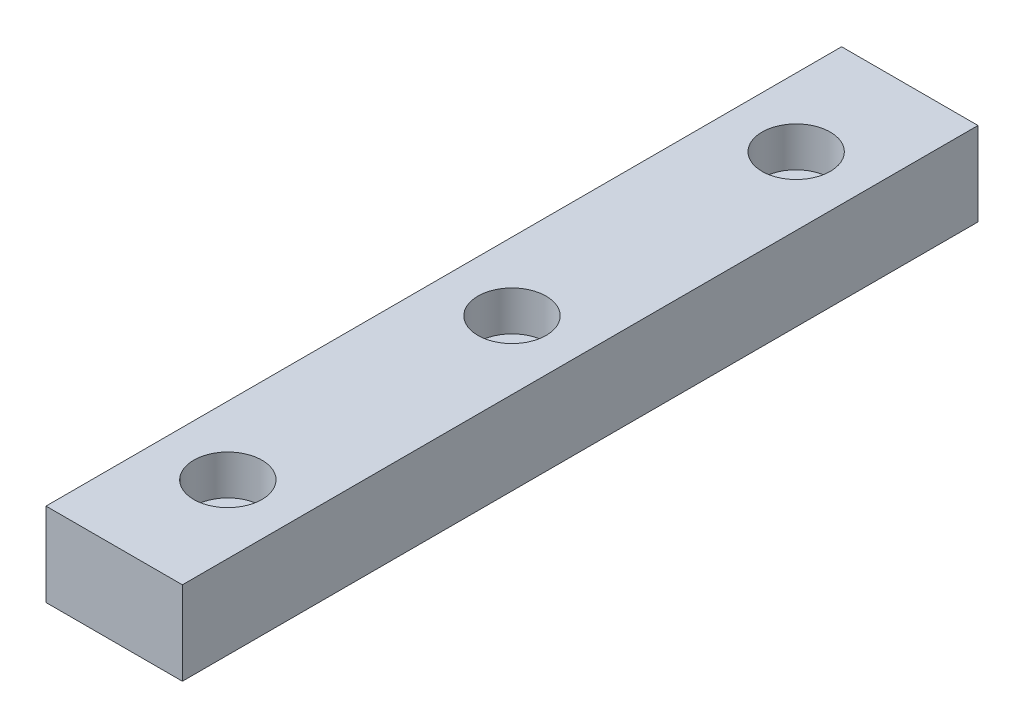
ISO-10303-21;
HEADER;
FILE_DESCRIPTION(('STEP AP214'),'2;1');
FILE_NAME('part.step','',(''),(''),'','','');
FILE_SCHEMA(('AUTOMOTIVE_DESIGN { 1 0 10303 214 1 1 1 1 }'));
ENDSEC;
DATA;
#1=APPLICATION_CONTEXT('core data for automotive mechanical design processes');
#2=APPLICATION_PROTOCOL_DEFINITION('international standard','automotive_design',2000,#1);
#3=PRODUCT_CONTEXT('',#1,'mechanical');
#4=PRODUCT('Part','Part','',(#3));
#5=PRODUCT_RELATED_PRODUCT_CATEGORY('part','',(#4));
#6=PRODUCT_DEFINITION_FORMATION('','',#4);
#7=PRODUCT_DEFINITION_CONTEXT('part definition',#1,'design');
#8=PRODUCT_DEFINITION('design','',#6,#7);
#9=PRODUCT_DEFINITION_SHAPE('','',#8);
#10=(LENGTH_UNIT() NAMED_UNIT(*) SI_UNIT(.MILLI.,.METRE.));
#11=(NAMED_UNIT(*) PLANE_ANGLE_UNIT() SI_UNIT($,.RADIAN.));
#12=(NAMED_UNIT(*) SI_UNIT($,.STERADIAN.) SOLID_ANGLE_UNIT());
#13=UNCERTAINTY_MEASURE_WITH_UNIT(LENGTH_MEASURE(1.E-05),#10,'distance_accuracy_value','');
#14=(GEOMETRIC_REPRESENTATION_CONTEXT(3) GLOBAL_UNCERTAINTY_ASSIGNED_CONTEXT((#13)) GLOBAL_UNIT_ASSIGNED_CONTEXT((#10,
#11,#12)) REPRESENTATION_CONTEXT('',''));
#15=CARTESIAN_POINT('',(0.,0.,0.));
#16=DIRECTION('',(0.,0.,1.));
#17=DIRECTION('',(1.,0.,0.));
#18=AXIS2_PLACEMENT_3D('',#15,#16,#17);
#19=CARTESIAN_POINT('',(6.,-62.6500000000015,10.));
#20=DIRECTION('',(0.,1.,0.));
#21=DIRECTION('',(0.,0.,1.));
#22=AXIS2_PLACEMENT_3D('',#19,#20,#21);
#23=CYLINDRICAL_SURFACE('',#22,1.75);
#24=CARTESIAN_POINT('',(6.,0.,10.));
#25=DIRECTION('',(0.,1.,0.));
#26=DIRECTION('',(0.,0.,1.));
#27=AXIS2_PLACEMENT_3D('',#24,#25,#26);
#28=CIRCLE('',#27,1.75);
#29=CARTESIAN_POINT('',(6.,0.,11.75));
#30=VERTEX_POINT('',#29);
#31=EDGE_CURVE('E110',#30,#30,#28,.T.);
#32=ORIENTED_EDGE('',*,*,#31,.F.);
#33=EDGE_LOOP('',(#32));
#34=FACE_BOUND('',#33,.T.);
#35=CARTESIAN_POINT('',(6.,3.84999999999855,10.));
#36=DIRECTION('',(0.,1.,0.));
#37=DIRECTION('',(0.,0.,1.));
#38=AXIS2_PLACEMENT_3D('',#35,#36,#37);
#39=CIRCLE('',#38,1.75);
#40=CARTESIAN_POINT('',(6.,3.84999999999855,11.75));
#41=VERTEX_POINT('',#40);
#42=EDGE_CURVE('E36',#41,#41,#39,.F.);
#43=ORIENTED_EDGE('',*,*,#42,.F.);
#44=EDGE_LOOP('',(#43));
#45=FACE_BOUND('',#44,.T.);
#46=ADVANCED_FACE('F32',(#34,#45),#23,.F.);
#47=CARTESIAN_POINT('',(6.,-62.6500000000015,35.));
#48=DIRECTION('',(0.,1.,0.));
#49=DIRECTION('',(0.,0.,1.));
#50=AXIS2_PLACEMENT_3D('',#47,#48,#49);
#51=CYLINDRICAL_SURFACE('',#50,1.75);
#52=CARTESIAN_POINT('',(6.,0.,35.));
#53=DIRECTION('',(0.,1.,0.));
#54=DIRECTION('',(0.,0.,1.));
#55=AXIS2_PLACEMENT_3D('',#52,#53,#54);
#56=CIRCLE('',#55,1.75);
#57=CARTESIAN_POINT('',(6.,0.,36.75));
#58=VERTEX_POINT('',#57);
#59=EDGE_CURVE('E135',#58,#58,#56,.T.);
#60=ORIENTED_EDGE('',*,*,#59,.F.);
#61=EDGE_LOOP('',(#60));
#62=FACE_BOUND('',#61,.T.);
#63=CARTESIAN_POINT('',(6.,3.84999999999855,35.));
#64=DIRECTION('',(0.,1.,0.));
#65=DIRECTION('',(0.,0.,1.));
#66=AXIS2_PLACEMENT_3D('',#63,#64,#65);
#67=CIRCLE('',#66,1.75);
#68=CARTESIAN_POINT('',(6.,3.84999999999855,36.75));
#69=VERTEX_POINT('',#68);
#70=EDGE_CURVE('E112',#69,#69,#67,.F.);
#71=ORIENTED_EDGE('',*,*,#70,.F.);
#72=EDGE_LOOP('',(#71));
#73=FACE_BOUND('',#72,.T.);
#74=ADVANCED_FACE('F145',(#62,#73),#51,.F.);
#75=CARTESIAN_POINT('',(6.,-62.6500000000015,60.));
#76=DIRECTION('',(0.,1.,0.));
#77=DIRECTION('',(0.,0.,1.));
#78=AXIS2_PLACEMENT_3D('',#75,#76,#77);
#79=CYLINDRICAL_SURFACE('',#78,1.75);
#80=CARTESIAN_POINT('',(6.,0.,60.));
#81=DIRECTION('',(0.,1.,0.));
#82=DIRECTION('',(0.,0.,1.));
#83=AXIS2_PLACEMENT_3D('',#80,#81,#82);
#84=CIRCLE('',#83,1.75);
#85=CARTESIAN_POINT('',(6.,0.,61.75));
#86=VERTEX_POINT('',#85);
#87=EDGE_CURVE('E102',#86,#86,#84,.T.);
#88=ORIENTED_EDGE('',*,*,#87,.F.);
#89=EDGE_LOOP('',(#88));
#90=FACE_BOUND('',#89,.T.);
#91=CARTESIAN_POINT('',(6.,3.84999999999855,60.));
#92=DIRECTION('',(0.,1.,0.));
#93=DIRECTION('',(0.,0.,1.));
#94=AXIS2_PLACEMENT_3D('',#91,#92,#93);
#95=CIRCLE('',#94,1.75);
#96=CARTESIAN_POINT('',(6.,3.84999999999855,61.75));
#97=VERTEX_POINT('',#96);
#98=EDGE_CURVE('E108',#97,#97,#95,.F.);
#99=ORIENTED_EDGE('',*,*,#98,.F.);
#100=EDGE_LOOP('',(#99));
#101=FACE_BOUND('',#100,.T.);
#102=ADVANCED_FACE('F142',(#90,#101),#79,.F.);
#103=CARTESIAN_POINT('',(0.,0.,70.));
#104=DIRECTION('',(1.,0.,0.));
#105=DIRECTION('',(0.,0.,-1.));
#106=AXIS2_PLACEMENT_3D('',#103,#104,#105);
#107=PLANE('',#106);
#108=DIRECTION('',(0.,-1.,0.));
#109=VECTOR('',#108,1.);
#110=CARTESIAN_POINT('',(0.,0.,0.));
#111=LINE('',#110,#109);
#112=CARTESIAN_POINT('',(0.,7.34999999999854,0.));
#113=VERTEX_POINT('',#112);
#114=CARTESIAN_POINT('',(0.,0.,0.));
#115=VERTEX_POINT('',#114);
#116=EDGE_CURVE('E99',#113,#115,#111,.T.);
#117=ORIENTED_EDGE('',*,*,#116,.T.);
#118=DIRECTION('',(0.,0.,-1.));
#119=VECTOR('',#118,1.);
#120=CARTESIAN_POINT('',(0.,0.,70.));
#121=LINE('',#120,#119);
#122=CARTESIAN_POINT('',(0.,0.,70.));
#123=VERTEX_POINT('',#122);
#124=EDGE_CURVE('E11',#123,#115,#121,.T.);
#125=ORIENTED_EDGE('',*,*,#124,.F.);
#126=DIRECTION('',(0.,-1.,0.));
#127=VECTOR('',#126,1.);
#128=CARTESIAN_POINT('',(0.,0.,70.));
#129=LINE('',#128,#127);
#130=CARTESIAN_POINT('',(0.,7.34999999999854,70.));
#131=VERTEX_POINT('',#130);
#132=EDGE_CURVE('E86',#131,#123,#129,.T.);
#133=ORIENTED_EDGE('',*,*,#132,.F.);
#134=DIRECTION('',(0.,0.,-1.));
#135=VECTOR('',#134,1.);
#136=CARTESIAN_POINT('',(0.,7.34999999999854,70.));
#137=LINE('',#136,#135);
#138=EDGE_CURVE('E95',#131,#113,#137,.T.);
#139=ORIENTED_EDGE('',*,*,#138,.T.);
#140=EDGE_LOOP('',(#117,#125,#133,#139));
#141=FACE_BOUND('',#140,.T.);
#142=ADVANCED_FACE('F34',(#141),#107,.F.);
#143=CARTESIAN_POINT('',(0.,0.,70.));
#144=DIRECTION('',(0.,1.,0.));
#145=DIRECTION('',(0.,0.,1.));
#146=AXIS2_PLACEMENT_3D('',#143,#144,#145);
#147=PLANE('',#146);
#148=ORIENTED_EDGE('',*,*,#31,.T.);
#149=EDGE_LOOP('',(#148));
#150=FACE_BOUND('',#149,.T.);
#151=ORIENTED_EDGE('',*,*,#59,.T.);
#152=EDGE_LOOP('',(#151));
#153=FACE_BOUND('',#152,.T.);
#154=ORIENTED_EDGE('',*,*,#87,.T.);
#155=EDGE_LOOP('',(#154));
#156=FACE_BOUND('',#155,.T.);
#157=DIRECTION('',(1.,0.,0.));
#158=VECTOR('',#157,1.);
#159=CARTESIAN_POINT('',(0.,0.,0.));
#160=LINE('',#159,#158);
#161=CARTESIAN_POINT('',(12.,0.,0.));
#162=VERTEX_POINT('',#161);
#163=EDGE_CURVE('E90',#115,#162,#160,.T.);
#164=ORIENTED_EDGE('',*,*,#163,.T.);
#165=DIRECTION('',(0.,0.,-1.));
#166=VECTOR('',#165,1.);
#167=CARTESIAN_POINT('',(12.,0.,70.));
#168=LINE('',#167,#166);
#169=CARTESIAN_POINT('',(12.,0.,70.));
#170=VERTEX_POINT('',#169);
#171=EDGE_CURVE('E42',#170,#162,#168,.T.);
#172=ORIENTED_EDGE('',*,*,#171,.F.);
#173=DIRECTION('',(1.,0.,0.));
#174=VECTOR('',#173,1.);
#175=CARTESIAN_POINT('',(0.,0.,70.));
#176=LINE('',#175,#174);
#177=EDGE_CURVE('E81',#123,#170,#176,.T.);
#178=ORIENTED_EDGE('',*,*,#177,.F.);
#179=ORIENTED_EDGE('',*,*,#124,.T.);
#180=EDGE_LOOP('',(#164,#172,#178,#179));
#181=FACE_BOUND('',#180,.T.);
#182=ADVANCED_FACE('F89',(#150,#153,#156,#181),#147,.F.);
#183=CARTESIAN_POINT('',(12.,0.,70.));
#184=DIRECTION('',(-1.,0.,0.));
#185=DIRECTION('',(0.,0.,1.));
#186=AXIS2_PLACEMENT_3D('',#183,#184,#185);
#187=PLANE('',#186);
#188=DIRECTION('',(0.,1.,0.));
#189=VECTOR('',#188,1.);
#190=CARTESIAN_POINT('',(12.,0.,0.));
#191=LINE('',#190,#189);
#192=CARTESIAN_POINT('',(12.,7.34999999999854,0.));
#193=VERTEX_POINT('',#192);
#194=EDGE_CURVE('E68',#162,#193,#191,.T.);
#195=ORIENTED_EDGE('',*,*,#194,.T.);
#196=DIRECTION('',(0.,0.,-1.));
#197=VECTOR('',#196,1.);
#198=CARTESIAN_POINT('',(12.,7.34999999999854,70.));
#199=LINE('',#198,#197);
#200=CARTESIAN_POINT('',(12.,7.34999999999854,70.));
#201=VERTEX_POINT('',#200);
#202=EDGE_CURVE('E91',#201,#193,#199,.T.);
#203=ORIENTED_EDGE('',*,*,#202,.F.);
#204=DIRECTION('',(0.,1.,0.));
#205=VECTOR('',#204,1.);
#206=CARTESIAN_POINT('',(12.,0.,70.));
#207=LINE('',#206,#205);
#208=EDGE_CURVE('E84',#170,#201,#207,.T.);
#209=ORIENTED_EDGE('',*,*,#208,.F.);
#210=ORIENTED_EDGE('',*,*,#171,.T.);
#211=EDGE_LOOP('',(#195,#203,#209,#210));
#212=FACE_BOUND('',#211,.T.);
#213=ADVANCED_FACE('F93',(#212),#187,.F.);
#214=CARTESIAN_POINT('',(0.,7.34999999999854,70.));
#215=DIRECTION('',(0.,-1.,0.));
#216=DIRECTION('',(0.,0.,-1.));
#217=AXIS2_PLACEMENT_3D('',#214,#215,#216);
#218=PLANE('',#217);
#219=CARTESIAN_POINT('',(6.,7.34999999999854,10.));
#220=DIRECTION('',(0.,1.,0.));
#221=DIRECTION('',(0.,0.,1.));
#222=AXIS2_PLACEMENT_3D('',#219,#220,#221);
#223=CIRCLE('',#222,3.);
#224=CARTESIAN_POINT('',(6.,7.34999999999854,13.));
#225=VERTEX_POINT('',#224);
#226=EDGE_CURVE('E128',#225,#225,#223,.T.);
#227=ORIENTED_EDGE('',*,*,#226,.F.);
#228=EDGE_LOOP('',(#227));
#229=FACE_BOUND('',#228,.T.);
#230=CARTESIAN_POINT('',(6.,7.34999999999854,35.));
#231=DIRECTION('',(0.,1.,0.));
#232=DIRECTION('',(0.,0.,1.));
#233=AXIS2_PLACEMENT_3D('',#230,#231,#232);
#234=CIRCLE('',#233,3.);
#235=CARTESIAN_POINT('',(6.,7.34999999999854,38.));
#236=VERTEX_POINT('',#235);
#237=EDGE_CURVE('E121',#236,#236,#234,.T.);
#238=ORIENTED_EDGE('',*,*,#237,.F.);
#239=EDGE_LOOP('',(#238));
#240=FACE_BOUND('',#239,.T.);
#241=CARTESIAN_POINT('',(6.,7.34999999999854,60.));
#242=DIRECTION('',(0.,1.,0.));
#243=DIRECTION('',(0.,0.,1.));
#244=AXIS2_PLACEMENT_3D('',#241,#242,#243);
#245=CIRCLE('',#244,3.);
#246=CARTESIAN_POINT('',(6.,7.34999999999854,63.));
#247=VERTEX_POINT('',#246);
#248=EDGE_CURVE('E114',#247,#247,#245,.T.);
#249=ORIENTED_EDGE('',*,*,#248,.F.);
#250=EDGE_LOOP('',(#249));
#251=FACE_BOUND('',#250,.T.);
#252=DIRECTION('',(-1.,0.,0.));
#253=VECTOR('',#252,1.);
#254=CARTESIAN_POINT('',(0.,7.34999999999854,0.));
#255=LINE('',#254,#253);
#256=EDGE_CURVE('E74',#193,#113,#255,.T.);
#257=ORIENTED_EDGE('',*,*,#256,.T.);
#258=ORIENTED_EDGE('',*,*,#138,.F.);
#259=DIRECTION('',(-1.,0.,0.));
#260=VECTOR('',#259,1.);
#261=CARTESIAN_POINT('',(0.,7.34999999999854,70.));
#262=LINE('',#261,#260);
#263=EDGE_CURVE('E51',#201,#131,#262,.T.);
#264=ORIENTED_EDGE('',*,*,#263,.F.);
#265=ORIENTED_EDGE('',*,*,#202,.T.);
#266=EDGE_LOOP('',(#257,#258,#264,#265));
#267=FACE_BOUND('',#266,.T.);
#268=ADVANCED_FACE('F177',(#229,#240,#251,#267),#218,.F.);
#269=CARTESIAN_POINT('',(0.,7.34999999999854,70.));
#270=DIRECTION('',(0.,0.,-1.));
#271=DIRECTION('',(-1.,0.,0.));
#272=AXIS2_PLACEMENT_3D('',#269,#270,#271);
#273=PLANE('',#272);
#274=ORIENTED_EDGE('',*,*,#132,.T.);
#275=ORIENTED_EDGE('',*,*,#177,.T.);
#276=ORIENTED_EDGE('',*,*,#208,.T.);
#277=ORIENTED_EDGE('',*,*,#263,.T.);
#278=EDGE_LOOP('',(#274,#275,#276,#277));
#279=FACE_BOUND('',#278,.T.);
#280=ADVANCED_FACE('F82',(#279),#273,.F.);
#281=CARTESIAN_POINT('',(0.,7.34999999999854,0.));
#282=DIRECTION('',(0.,0.,-1.));
#283=DIRECTION('',(-1.,0.,0.));
#284=AXIS2_PLACEMENT_3D('',#281,#282,#283);
#285=PLANE('',#284);
#286=ORIENTED_EDGE('',*,*,#116,.F.);
#287=ORIENTED_EDGE('',*,*,#256,.F.);
#288=ORIENTED_EDGE('',*,*,#194,.F.);
#289=ORIENTED_EDGE('',*,*,#163,.F.);
#290=EDGE_LOOP('',(#286,#287,#288,#289));
#291=FACE_BOUND('',#290,.T.);
#292=ADVANCED_FACE('F152',(#291),#285,.T.);
#293=CARTESIAN_POINT('',(6.,3.84999999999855,60.));
#294=DIRECTION('',(0.,1.,0.));
#295=DIRECTION('',(0.,0.,1.));
#296=AXIS2_PLACEMENT_3D('',#293,#294,#295);
#297=PLANE('',#296);
#298=CARTESIAN_POINT('',(6.,3.84999999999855,60.));
#299=DIRECTION('',(0.,1.,0.));
#300=DIRECTION('',(0.,0.,1.));
#301=AXIS2_PLACEMENT_3D('',#298,#299,#300);
#302=CIRCLE('',#301,3.);
#303=CARTESIAN_POINT('',(6.,3.84999999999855,63.));
#304=VERTEX_POINT('',#303);
#305=EDGE_CURVE('E111',#304,#304,#302,.T.);
#306=ORIENTED_EDGE('',*,*,#305,.T.);
#307=EDGE_LOOP('',(#306));
#308=FACE_BOUND('',#307,.T.);
#309=ORIENTED_EDGE('',*,*,#98,.T.);
#310=EDGE_LOOP('',(#309));
#311=FACE_BOUND('',#310,.T.);
#312=ADVANCED_FACE('F149',(#308,#311),#297,.T.);
#313=CARTESIAN_POINT('',(6.,3.84999999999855,60.));
#314=DIRECTION('',(0.,1.,0.));
#315=DIRECTION('',(0.,0.,1.));
#316=AXIS2_PLACEMENT_3D('',#313,#314,#315);
#317=CYLINDRICAL_SURFACE('',#316,3.);
#318=ORIENTED_EDGE('',*,*,#305,.F.);
#319=EDGE_LOOP('',(#318));
#320=FACE_BOUND('',#319,.T.);
#321=ORIENTED_EDGE('',*,*,#248,.T.);
#322=EDGE_LOOP('',(#321));
#323=FACE_BOUND('',#322,.T.);
#324=ADVANCED_FACE('F151',(#320,#323),#317,.F.);
#325=CARTESIAN_POINT('',(6.,3.84999999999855,35.));
#326=DIRECTION('',(0.,1.,0.));
#327=DIRECTION('',(0.,0.,1.));
#328=AXIS2_PLACEMENT_3D('',#325,#326,#327);
#329=PLANE('',#328);
#330=CARTESIAN_POINT('',(6.,3.84999999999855,35.));
#331=DIRECTION('',(0.,1.,0.));
#332=DIRECTION('',(0.,0.,1.));
#333=AXIS2_PLACEMENT_3D('',#330,#331,#332);
#334=CIRCLE('',#333,3.);
#335=CARTESIAN_POINT('',(6.,3.84999999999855,38.));
#336=VERTEX_POINT('',#335);
#337=EDGE_CURVE('E115',#336,#336,#334,.T.);
#338=ORIENTED_EDGE('',*,*,#337,.T.);
#339=EDGE_LOOP('',(#338));
#340=FACE_BOUND('',#339,.T.);
#341=ORIENTED_EDGE('',*,*,#70,.T.);
#342=EDGE_LOOP('',(#341));
#343=FACE_BOUND('',#342,.T.);
#344=ADVANCED_FACE('F159',(#340,#343),#329,.T.);
#345=CARTESIAN_POINT('',(6.,3.84999999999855,35.));
#346=DIRECTION('',(0.,1.,0.));
#347=DIRECTION('',(0.,0.,1.));
#348=AXIS2_PLACEMENT_3D('',#345,#346,#347);
#349=CYLINDRICAL_SURFACE('',#348,3.);
#350=ORIENTED_EDGE('',*,*,#337,.F.);
#351=EDGE_LOOP('',(#350));
#352=FACE_BOUND('',#351,.T.);
#353=ORIENTED_EDGE('',*,*,#237,.T.);
#354=EDGE_LOOP('',(#353));
#355=FACE_BOUND('',#354,.T.);
#356=ADVANCED_FACE('F254',(#352,#355),#349,.F.);
#357=CARTESIAN_POINT('',(6.,3.84999999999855,10.));
#358=DIRECTION('',(0.,1.,0.));
#359=DIRECTION('',(0.,0.,1.));
#360=AXIS2_PLACEMENT_3D('',#357,#358,#359);
#361=PLANE('',#360);
#362=CARTESIAN_POINT('',(6.,3.84999999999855,10.));
#363=DIRECTION('',(0.,1.,0.));
#364=DIRECTION('',(0.,0.,1.));
#365=AXIS2_PLACEMENT_3D('',#362,#363,#364);
#366=CIRCLE('',#365,3.);
#367=CARTESIAN_POINT('',(6.,3.84999999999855,13.));
#368=VERTEX_POINT('',#367);
#369=EDGE_CURVE('E289',#368,#368,#366,.T.);
#370=ORIENTED_EDGE('',*,*,#369,.T.);
#371=EDGE_LOOP('',(#370));
#372=FACE_BOUND('',#371,.T.);
#373=ORIENTED_EDGE('',*,*,#42,.T.);
#374=EDGE_LOOP('',(#373));
#375=FACE_BOUND('',#374,.T.);
#376=ADVANCED_FACE('F263',(#372,#375),#361,.T.);
#377=CARTESIAN_POINT('',(6.,3.84999999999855,10.));
#378=DIRECTION('',(0.,1.,0.));
#379=DIRECTION('',(0.,0.,1.));
#380=AXIS2_PLACEMENT_3D('',#377,#378,#379);
#381=CYLINDRICAL_SURFACE('',#380,3.);
#382=ORIENTED_EDGE('',*,*,#369,.F.);
#383=EDGE_LOOP('',(#382));
#384=FACE_BOUND('',#383,.T.);
#385=ORIENTED_EDGE('',*,*,#226,.T.);
#386=EDGE_LOOP('',(#385));
#387=FACE_BOUND('',#386,.T.);
#388=ADVANCED_FACE('F272',(#384,#387),#381,.F.);
#389=CLOSED_SHELL('',(#46,#74,#102,#142,#182,#213,#268,#280,#292,#312,#324,#344,#356,#376,#388));
#390=MANIFOLD_SOLID_BREP('B2',#389);
#391=ADVANCED_BREP_SHAPE_REPRESENTATION('',(#18,#390),#14);
#392=SHAPE_DEFINITION_REPRESENTATION(#9,#391);
ENDSEC;
END-ISO-10303-21;
